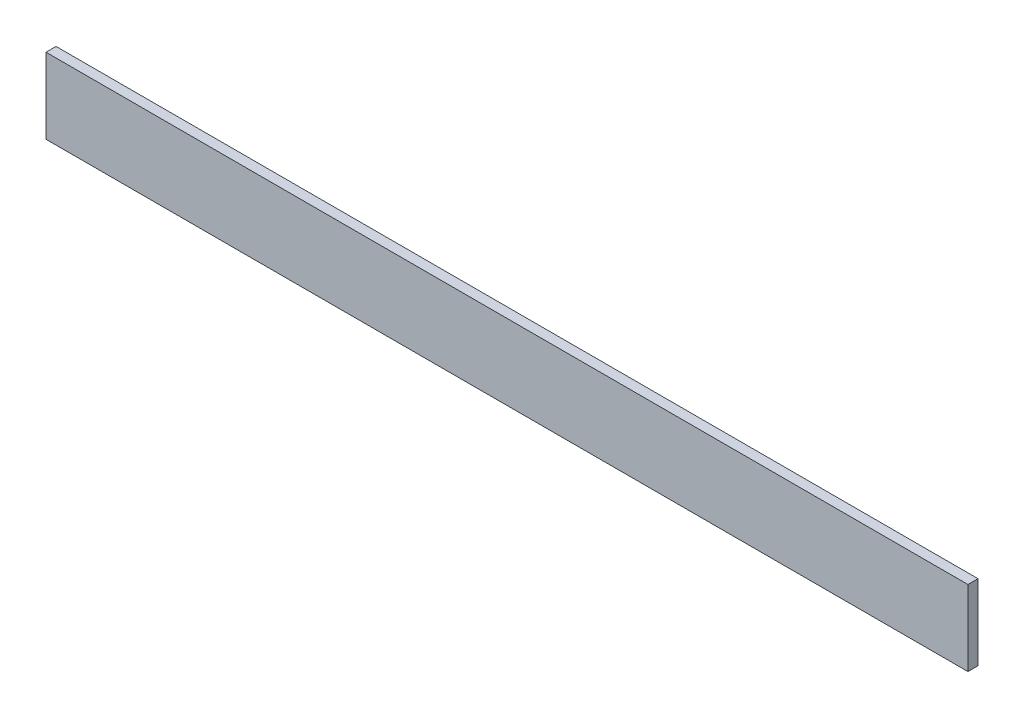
ISO-10303-21;
HEADER;
FILE_DESCRIPTION(('STEP AP214'),'2;1');
FILE_NAME('part.step','',(''),(''),'','','');
FILE_SCHEMA(('AUTOMOTIVE_DESIGN { 1 0 10303 214 1 1 1 1 }'));
ENDSEC;
DATA;
#1=APPLICATION_CONTEXT('core data for automotive mechanical design processes');
#2=APPLICATION_PROTOCOL_DEFINITION('international standard','automotive_design',2000,#1);
#3=PRODUCT_CONTEXT('',#1,'mechanical');
#4=PRODUCT('Part','Part','',(#3));
#5=PRODUCT_RELATED_PRODUCT_CATEGORY('part','',(#4));
#6=PRODUCT_DEFINITION_FORMATION('','',#4);
#7=PRODUCT_DEFINITION_CONTEXT('part definition',#1,'design');
#8=PRODUCT_DEFINITION('design','',#6,#7);
#9=PRODUCT_DEFINITION_SHAPE('','',#8);
#10=(LENGTH_UNIT() NAMED_UNIT(*) SI_UNIT(.MILLI.,.METRE.));
#11=(NAMED_UNIT(*) PLANE_ANGLE_UNIT() SI_UNIT($,.RADIAN.));
#12=(NAMED_UNIT(*) SI_UNIT($,.STERADIAN.) SOLID_ANGLE_UNIT());
#13=UNCERTAINTY_MEASURE_WITH_UNIT(LENGTH_MEASURE(1.E-05),#10,'distance_accuracy_value','');
#14=(GEOMETRIC_REPRESENTATION_CONTEXT(3) GLOBAL_UNCERTAINTY_ASSIGNED_CONTEXT((#13)) GLOBAL_UNIT_ASSIGNED_CONTEXT((#10,
#11,#12)) REPRESENTATION_CONTEXT('',''));
#15=CARTESIAN_POINT('',(0.,0.,0.));
#16=DIRECTION('',(0.,0.,1.));
#17=DIRECTION('',(1.,0.,0.));
#18=AXIS2_PLACEMENT_3D('',#15,#16,#17);
#19=CARTESIAN_POINT('',(550.,45.,12.));
#20=DIRECTION('',(-1.,0.,0.));
#21=DIRECTION('',(0.,0.,1.));
#22=AXIS2_PLACEMENT_3D('',#19,#20,#21);
#23=PLANE('',#22);
#24=DIRECTION('',(0.,1.,0.));
#25=VECTOR('',#24,1.);
#26=CARTESIAN_POINT('',(550.,45.,0.));
#27=LINE('',#26,#25);
#28=CARTESIAN_POINT('',(550.,-45.,0.));
#29=VERTEX_POINT('',#28);
#30=CARTESIAN_POINT('',(550.,45.,0.));
#31=VERTEX_POINT('',#30);
#32=EDGE_CURVE('E96',#29,#31,#27,.T.);
#33=ORIENTED_EDGE('',*,*,#32,.T.);
#34=DIRECTION('',(0.,0.,-1.));
#35=VECTOR('',#34,1.);
#36=CARTESIAN_POINT('',(550.,45.,12.));
#37=LINE('',#36,#35);
#38=CARTESIAN_POINT('',(550.,45.,12.));
#39=VERTEX_POINT('',#38);
#40=EDGE_CURVE('E11',#39,#31,#37,.T.);
#41=ORIENTED_EDGE('',*,*,#40,.F.);
#42=DIRECTION('',(0.,1.,0.));
#43=VECTOR('',#42,1.);
#44=CARTESIAN_POINT('',(550.,45.,12.));
#45=LINE('',#44,#43);
#46=CARTESIAN_POINT('',(550.,-45.,12.));
#47=VERTEX_POINT('',#46);
#48=EDGE_CURVE('E84',#47,#39,#45,.T.);
#49=ORIENTED_EDGE('',*,*,#48,.F.);
#50=DIRECTION('',(0.,0.,-1.));
#51=VECTOR('',#50,1.);
#52=CARTESIAN_POINT('',(550.,-45.,12.));
#53=LINE('',#52,#51);
#54=EDGE_CURVE('E92',#47,#29,#53,.T.);
#55=ORIENTED_EDGE('',*,*,#54,.T.);
#56=EDGE_LOOP('',(#33,#41,#49,#55));
#57=FACE_BOUND('',#56,.T.);
#58=ADVANCED_FACE('F33',(#57),#23,.F.);
#59=CARTESIAN_POINT('',(-550.,45.,12.));
#60=DIRECTION('',(0.,-1.,0.));
#61=DIRECTION('',(0.,0.,-1.));
#62=AXIS2_PLACEMENT_3D('',#59,#60,#61);
#63=PLANE('',#62);
#64=DIRECTION('',(-1.,0.,0.));
#65=VECTOR('',#64,1.);
#66=CARTESIAN_POINT('',(-550.,45.,0.));
#67=LINE('',#66,#65);
#68=CARTESIAN_POINT('',(-550.,45.,0.));
#69=VERTEX_POINT('',#68);
#70=EDGE_CURVE('E88',#31,#69,#67,.T.);
#71=ORIENTED_EDGE('',*,*,#70,.T.);
#72=DIRECTION('',(0.,0.,-1.));
#73=VECTOR('',#72,1.);
#74=CARTESIAN_POINT('',(-550.,45.,12.));
#75=LINE('',#74,#73);
#76=CARTESIAN_POINT('',(-550.,45.,12.));
#77=VERTEX_POINT('',#76);
#78=EDGE_CURVE('E41',#77,#69,#75,.T.);
#79=ORIENTED_EDGE('',*,*,#78,.F.);
#80=DIRECTION('',(-1.,0.,0.));
#81=VECTOR('',#80,1.);
#82=CARTESIAN_POINT('',(-550.,45.,12.));
#83=LINE('',#82,#81);
#84=EDGE_CURVE('E79',#39,#77,#83,.T.);
#85=ORIENTED_EDGE('',*,*,#84,.F.);
#86=ORIENTED_EDGE('',*,*,#40,.T.);
#87=EDGE_LOOP('',(#71,#79,#85,#86));
#88=FACE_BOUND('',#87,.T.);
#89=ADVANCED_FACE('F87',(#88),#63,.F.);
#90=CARTESIAN_POINT('',(-550.,45.,12.));
#91=DIRECTION('',(1.,0.,0.));
#92=DIRECTION('',(0.,0.,-1.));
#93=AXIS2_PLACEMENT_3D('',#90,#91,#92);
#94=PLANE('',#93);
#95=DIRECTION('',(0.,-1.,0.));
#96=VECTOR('',#95,1.);
#97=CARTESIAN_POINT('',(-550.,45.,0.));
#98=LINE('',#97,#96);
#99=CARTESIAN_POINT('',(-550.,-45.,0.));
#100=VERTEX_POINT('',#99);
#101=EDGE_CURVE('E66',#69,#100,#98,.T.);
#102=ORIENTED_EDGE('',*,*,#101,.T.);
#103=DIRECTION('',(0.,0.,-1.));
#104=VECTOR('',#103,1.);
#105=CARTESIAN_POINT('',(-550.,-45.,12.));
#106=LINE('',#105,#104);
#107=CARTESIAN_POINT('',(-550.,-45.,12.));
#108=VERTEX_POINT('',#107);
#109=EDGE_CURVE('E89',#108,#100,#106,.T.);
#110=ORIENTED_EDGE('',*,*,#109,.F.);
#111=DIRECTION('',(0.,-1.,0.));
#112=VECTOR('',#111,1.);
#113=CARTESIAN_POINT('',(-550.,45.,12.));
#114=LINE('',#113,#112);
#115=EDGE_CURVE('E82',#77,#108,#114,.T.);
#116=ORIENTED_EDGE('',*,*,#115,.F.);
#117=ORIENTED_EDGE('',*,*,#78,.T.);
#118=EDGE_LOOP('',(#102,#110,#116,#117));
#119=FACE_BOUND('',#118,.T.);
#120=ADVANCED_FACE('F90',(#119),#94,.F.);
#121=CARTESIAN_POINT('',(-550.,-45.,12.));
#122=DIRECTION('',(0.,1.,0.));
#123=DIRECTION('',(0.,0.,1.));
#124=AXIS2_PLACEMENT_3D('',#121,#122,#123);
#125=PLANE('',#124);
#126=DIRECTION('',(1.,0.,0.));
#127=VECTOR('',#126,1.);
#128=CARTESIAN_POINT('',(-550.,-45.,0.));
#129=LINE('',#128,#127);
#130=EDGE_CURVE('E72',#100,#29,#129,.T.);
#131=ORIENTED_EDGE('',*,*,#130,.T.);
#132=ORIENTED_EDGE('',*,*,#54,.F.);
#133=DIRECTION('',(1.,0.,0.));
#134=VECTOR('',#133,1.);
#135=CARTESIAN_POINT('',(-550.,-45.,12.));
#136=LINE('',#135,#134);
#137=EDGE_CURVE('E49',#108,#47,#136,.T.);
#138=ORIENTED_EDGE('',*,*,#137,.F.);
#139=ORIENTED_EDGE('',*,*,#109,.T.);
#140=EDGE_LOOP('',(#131,#132,#138,#139));
#141=FACE_BOUND('',#140,.T.);
#142=ADVANCED_FACE('F103',(#141),#125,.F.);
#143=CARTESIAN_POINT('',(0.,0.,12.));
#144=DIRECTION('',(0.,0.,1.));
#145=DIRECTION('',(1.,0.,0.));
#146=AXIS2_PLACEMENT_3D('',#143,#144,#145);
#147=PLANE('',#146);
#148=ORIENTED_EDGE('',*,*,#48,.T.);
#149=ORIENTED_EDGE('',*,*,#84,.T.);
#150=ORIENTED_EDGE('',*,*,#115,.T.);
#151=ORIENTED_EDGE('',*,*,#137,.T.);
#152=EDGE_LOOP('',(#148,#149,#150,#151));
#153=FACE_BOUND('',#152,.T.);
#154=ADVANCED_FACE('F80',(#153),#147,.T.);
#155=CARTESIAN_POINT('',(0.,0.,0.));
#156=DIRECTION('',(0.,0.,1.));
#157=DIRECTION('',(1.,0.,0.));
#158=AXIS2_PLACEMENT_3D('',#155,#156,#157);
#159=PLANE('',#158);
#160=ORIENTED_EDGE('',*,*,#32,.F.);
#161=ORIENTED_EDGE('',*,*,#130,.F.);
#162=ORIENTED_EDGE('',*,*,#101,.F.);
#163=ORIENTED_EDGE('',*,*,#70,.F.);
#164=EDGE_LOOP('',(#160,#161,#162,#163));
#165=FACE_BOUND('',#164,.T.);
#166=ADVANCED_FACE('F106',(#165),#159,.F.);
#167=CLOSED_SHELL('',(#58,#89,#120,#142,#154,#166));
#168=MANIFOLD_SOLID_BREP('B2',#167);
#169=ADVANCED_BREP_SHAPE_REPRESENTATION('',(#18,#168),#14);
#170=SHAPE_DEFINITION_REPRESENTATION(#9,#169);
ENDSEC;
END-ISO-10303-21;
